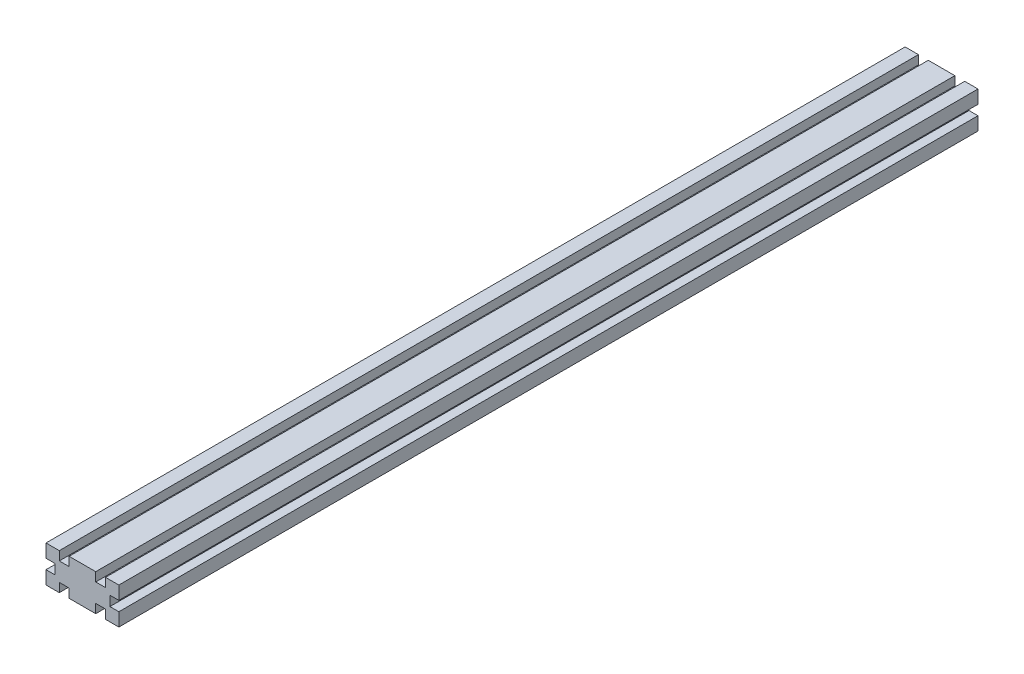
ISO-10303-21;
HEADER;
FILE_DESCRIPTION(('STEP AP214'),'2;1');
FILE_NAME('part.step','',(''),(''),'','','');
FILE_SCHEMA(('AUTOMOTIVE_DESIGN { 1 0 10303 214 1 1 1 1 }'));
ENDSEC;
DATA;
#1=APPLICATION_CONTEXT('core data for automotive mechanical design processes');
#2=APPLICATION_PROTOCOL_DEFINITION('international standard','automotive_design',2000,#1);
#3=PRODUCT_CONTEXT('',#1,'mechanical');
#4=PRODUCT('Part','Part','',(#3));
#5=PRODUCT_RELATED_PRODUCT_CATEGORY('part','',(#4));
#6=PRODUCT_DEFINITION_FORMATION('','',#4);
#7=PRODUCT_DEFINITION_CONTEXT('part definition',#1,'design');
#8=PRODUCT_DEFINITION('design','',#6,#7);
#9=PRODUCT_DEFINITION_SHAPE('','',#8);
#10=(LENGTH_UNIT() NAMED_UNIT(*) SI_UNIT(.MILLI.,.METRE.));
#11=(NAMED_UNIT(*) PLANE_ANGLE_UNIT() SI_UNIT($,.RADIAN.));
#12=(NAMED_UNIT(*) SI_UNIT($,.STERADIAN.) SOLID_ANGLE_UNIT());
#13=UNCERTAINTY_MEASURE_WITH_UNIT(LENGTH_MEASURE(1.E-05),#10,'distance_accuracy_value','');
#14=(GEOMETRIC_REPRESENTATION_CONTEXT(3) GLOBAL_UNCERTAINTY_ASSIGNED_CONTEXT((#13)) GLOBAL_UNIT_ASSIGNED_CONTEXT((#10,
#11,#12)) REPRESENTATION_CONTEXT('',''));
#15=CARTESIAN_POINT('',(0.,0.,0.));
#16=DIRECTION('',(0.,0.,1.));
#17=DIRECTION('',(1.,0.,0.));
#18=AXIS2_PLACEMENT_3D('',#15,#16,#17);
#19=CARTESIAN_POINT('',(11.6,0.,750.));
#20=DIRECTION('',(1.,0.,0.));
#21=DIRECTION('',(0.,1.,0.));
#22=AXIS2_PLACEMENT_3D('',#19,#20,#21);
#23=PLANE('',#22);
#24=DIRECTION('',(0.,-1.,0.));
#25=VECTOR('',#24,1.);
#26=CARTESIAN_POINT('',(11.6,0.,0.));
#27=LINE('',#26,#25);
#28=CARTESIAN_POINT('',(11.6,31.8,0.));
#29=VERTEX_POINT('',#28);
#30=CARTESIAN_POINT('',(11.6,24.,0.));
#31=VERTEX_POINT('',#30);
#32=EDGE_CURVE('E247',#29,#31,#27,.T.);
#33=ORIENTED_EDGE('',*,*,#32,.F.);
#34=DIRECTION('',(0.,0.,-1.));
#35=VECTOR('',#34,1.);
#36=CARTESIAN_POINT('',(11.6,31.8,750.));
#37=LINE('',#36,#35);
#38=CARTESIAN_POINT('',(11.6,31.8,750.));
#39=VERTEX_POINT('',#38);
#40=EDGE_CURVE('E11',#39,#29,#37,.T.);
#41=ORIENTED_EDGE('',*,*,#40,.F.);
#42=DIRECTION('',(0.,-1.,0.));
#43=VECTOR('',#42,1.);
#44=CARTESIAN_POINT('',(11.6,0.,750.));
#45=LINE('',#44,#43);
#46=CARTESIAN_POINT('',(11.6,24.,750.));
#47=VERTEX_POINT('',#46);
#48=EDGE_CURVE('E319',#39,#47,#45,.T.);
#49=ORIENTED_EDGE('',*,*,#48,.T.);
#50=DIRECTION('',(0.,0.,-1.));
#51=VECTOR('',#50,1.);
#52=CARTESIAN_POINT('',(11.6,24.,750.));
#53=LINE('',#52,#51);
#54=EDGE_CURVE('E50',#47,#31,#53,.T.);
#55=ORIENTED_EDGE('',*,*,#54,.T.);
#56=EDGE_LOOP('',(#33,#41,#49,#55));
#57=FACE_BOUND('',#56,.T.);
#58=ADVANCED_FACE('F34',(#57),#23,.T.);
#59=CARTESIAN_POINT('',(0.,31.8,750.));
#60=DIRECTION('',(0.,1.,0.));
#61=DIRECTION('',(0.,0.,1.));
#62=AXIS2_PLACEMENT_3D('',#59,#60,#61);
#63=PLANE('',#62);
#64=DIRECTION('',(1.,0.,0.));
#65=VECTOR('',#64,1.);
#66=CARTESIAN_POINT('',(0.,31.8,0.));
#67=LINE('',#66,#65);
#68=CARTESIAN_POINT('',(-11.6,31.8,0.));
#69=VERTEX_POINT('',#68);
#70=EDGE_CURVE('E249',#69,#29,#67,.T.);
#71=ORIENTED_EDGE('',*,*,#70,.F.);
#72=DIRECTION('',(0.,0.,-1.));
#73=VECTOR('',#72,1.);
#74=CARTESIAN_POINT('',(-11.6,31.8,750.));
#75=LINE('',#74,#73);
#76=CARTESIAN_POINT('',(-11.6,31.8,750.));
#77=VERTEX_POINT('',#76);
#78=EDGE_CURVE('E42',#77,#69,#75,.T.);
#79=ORIENTED_EDGE('',*,*,#78,.F.);
#80=DIRECTION('',(1.,0.,0.));
#81=VECTOR('',#80,1.);
#82=CARTESIAN_POINT('',(0.,31.8,750.));
#83=LINE('',#82,#81);
#84=EDGE_CURVE('E396',#77,#39,#83,.T.);
#85=ORIENTED_EDGE('',*,*,#84,.T.);
#86=ORIENTED_EDGE('',*,*,#40,.T.);
#87=EDGE_LOOP('',(#71,#79,#85,#86));
#88=FACE_BOUND('',#87,.T.);
#89=ADVANCED_FACE('F384',(#88),#63,.T.);
#90=CARTESIAN_POINT('',(-11.6,0.,750.));
#91=DIRECTION('',(-1.,0.,0.));
#92=DIRECTION('',(0.,0.,1.));
#93=AXIS2_PLACEMENT_3D('',#90,#91,#92);
#94=PLANE('',#93);
#95=DIRECTION('',(0.,1.,0.));
#96=VECTOR('',#95,1.);
#97=CARTESIAN_POINT('',(-11.6,0.,0.));
#98=LINE('',#97,#96);
#99=CARTESIAN_POINT('',(-11.6,24.,0.));
#100=VERTEX_POINT('',#99);
#101=EDGE_CURVE('E252',#100,#69,#98,.T.);
#102=ORIENTED_EDGE('',*,*,#101,.F.);
#103=DIRECTION('',(0.,0.,-1.));
#104=VECTOR('',#103,1.);
#105=CARTESIAN_POINT('',(-11.6,24.,750.));
#106=LINE('',#105,#104);
#107=CARTESIAN_POINT('',(-11.6,24.,750.));
#108=VERTEX_POINT('',#107);
#109=EDGE_CURVE('E373',#108,#100,#106,.T.);
#110=ORIENTED_EDGE('',*,*,#109,.F.);
#111=DIRECTION('',(0.,1.,0.));
#112=VECTOR('',#111,1.);
#113=CARTESIAN_POINT('',(-11.6,0.,750.));
#114=LINE('',#113,#112);
#115=EDGE_CURVE('E380',#108,#77,#114,.T.);
#116=ORIENTED_EDGE('',*,*,#115,.T.);
#117=ORIENTED_EDGE('',*,*,#78,.T.);
#118=EDGE_LOOP('',(#102,#110,#116,#117));
#119=FACE_BOUND('',#118,.T.);
#120=ADVANCED_FACE('F378',(#119),#94,.T.);
#121=CARTESIAN_POINT('',(0.,24.,750.));
#122=DIRECTION('',(0.,1.,0.));
#123=DIRECTION('',(0.,0.,1.));
#124=AXIS2_PLACEMENT_3D('',#121,#122,#123);
#125=PLANE('',#124);
#126=DIRECTION('',(1.,0.,0.));
#127=VECTOR('',#126,1.);
#128=CARTESIAN_POINT('',(0.,24.,0.));
#129=LINE('',#128,#127);
#130=CARTESIAN_POINT('',(-20.2,24.,0.));
#131=VERTEX_POINT('',#130);
#132=EDGE_CURVE('E255',#131,#100,#129,.T.);
#133=ORIENTED_EDGE('',*,*,#132,.F.);
#134=DIRECTION('',(0.,0.,-1.));
#135=VECTOR('',#134,1.);
#136=CARTESIAN_POINT('',(-20.2,24.,750.));
#137=LINE('',#136,#135);
#138=CARTESIAN_POINT('',(-20.2,24.,750.));
#139=VERTEX_POINT('',#138);
#140=EDGE_CURVE('E371',#139,#131,#137,.T.);
#141=ORIENTED_EDGE('',*,*,#140,.F.);
#142=DIRECTION('',(1.,0.,0.));
#143=VECTOR('',#142,1.);
#144=CARTESIAN_POINT('',(0.,24.,750.));
#145=LINE('',#144,#143);
#146=EDGE_CURVE('E393',#139,#108,#145,.T.);
#147=ORIENTED_EDGE('',*,*,#146,.T.);
#148=ORIENTED_EDGE('',*,*,#109,.T.);
#149=EDGE_LOOP('',(#133,#141,#147,#148));
#150=FACE_BOUND('',#149,.T.);
#151=ADVANCED_FACE('F390',(#150),#125,.T.);
#152=CARTESIAN_POINT('',(-20.2,0.,750.));
#153=DIRECTION('',(1.,0.,0.));
#154=DIRECTION('',(0.,0.,-1.));
#155=AXIS2_PLACEMENT_3D('',#152,#153,#154);
#156=PLANE('',#155);
#157=DIRECTION('',(0.,-1.,0.));
#158=VECTOR('',#157,1.);
#159=CARTESIAN_POINT('',(-20.2,0.,0.));
#160=LINE('',#159,#158);
#161=CARTESIAN_POINT('',(-20.2,31.8,0.));
#162=VERTEX_POINT('',#161);
#163=EDGE_CURVE('E258',#162,#131,#160,.T.);
#164=ORIENTED_EDGE('',*,*,#163,.F.);
#165=DIRECTION('',(0.,0.,-1.));
#166=VECTOR('',#165,1.);
#167=CARTESIAN_POINT('',(-20.2,31.8,750.));
#168=LINE('',#167,#166);
#169=CARTESIAN_POINT('',(-20.2,31.8,750.));
#170=VERTEX_POINT('',#169);
#171=EDGE_CURVE('E369',#170,#162,#168,.T.);
#172=ORIENTED_EDGE('',*,*,#171,.F.);
#173=DIRECTION('',(0.,-1.,0.));
#174=VECTOR('',#173,1.);
#175=CARTESIAN_POINT('',(-20.2,0.,750.));
#176=LINE('',#175,#174);
#177=EDGE_CURVE('E398',#170,#139,#176,.T.);
#178=ORIENTED_EDGE('',*,*,#177,.T.);
#179=ORIENTED_EDGE('',*,*,#140,.T.);
#180=EDGE_LOOP('',(#164,#172,#178,#179));
#181=FACE_BOUND('',#180,.T.);
#182=ADVANCED_FACE('F476',(#181),#156,.T.);
#183=CARTESIAN_POINT('',(0.,31.8,750.));
#184=DIRECTION('',(0.,1.,0.));
#185=DIRECTION('',(0.,0.,1.));
#186=AXIS2_PLACEMENT_3D('',#183,#184,#185);
#187=PLANE('',#186);
#188=DIRECTION('',(1.,0.,0.));
#189=VECTOR('',#188,1.);
#190=CARTESIAN_POINT('',(0.,31.8,0.));
#191=LINE('',#190,#189);
#192=CARTESIAN_POINT('',(-31.8,31.8,0.));
#193=VERTEX_POINT('',#192);
#194=EDGE_CURVE('E261',#193,#162,#191,.T.);
#195=ORIENTED_EDGE('',*,*,#194,.F.);
#196=DIRECTION('',(0.,0.,-1.));
#197=VECTOR('',#196,1.);
#198=CARTESIAN_POINT('',(-31.8,31.8,750.));
#199=LINE('',#198,#197);
#200=CARTESIAN_POINT('',(-31.8,31.8,750.));
#201=VERTEX_POINT('',#200);
#202=EDGE_CURVE('E367',#201,#193,#199,.T.);
#203=ORIENTED_EDGE('',*,*,#202,.F.);
#204=DIRECTION('',(1.,0.,0.));
#205=VECTOR('',#204,1.);
#206=CARTESIAN_POINT('',(0.,31.8,750.));
#207=LINE('',#206,#205);
#208=EDGE_CURVE('E404',#201,#170,#207,.T.);
#209=ORIENTED_EDGE('',*,*,#208,.T.);
#210=ORIENTED_EDGE('',*,*,#171,.T.);
#211=EDGE_LOOP('',(#195,#203,#209,#210));
#212=FACE_BOUND('',#211,.T.);
#213=ADVANCED_FACE('F479',(#212),#187,.T.);
#214=CARTESIAN_POINT('',(-31.8,0.,750.));
#215=DIRECTION('',(-1.,0.,0.));
#216=DIRECTION('',(0.,0.,1.));
#217=AXIS2_PLACEMENT_3D('',#214,#215,#216);
#218=PLANE('',#217);
#219=DIRECTION('',(0.,1.,0.));
#220=VECTOR('',#219,1.);
#221=CARTESIAN_POINT('',(-31.8,0.,0.));
#222=LINE('',#221,#220);
#223=CARTESIAN_POINT('',(-31.8,20.2,0.));
#224=VERTEX_POINT('',#223);
#225=EDGE_CURVE('E264',#224,#193,#222,.T.);
#226=ORIENTED_EDGE('',*,*,#225,.F.);
#227=DIRECTION('',(0.,0.,-1.));
#228=VECTOR('',#227,1.);
#229=CARTESIAN_POINT('',(-31.8,20.2,750.));
#230=LINE('',#229,#228);
#231=CARTESIAN_POINT('',(-31.8,20.2,750.));
#232=VERTEX_POINT('',#231);
#233=EDGE_CURVE('E365',#232,#224,#230,.T.);
#234=ORIENTED_EDGE('',*,*,#233,.F.);
#235=DIRECTION('',(0.,1.,0.));
#236=VECTOR('',#235,1.);
#237=CARTESIAN_POINT('',(-31.8,0.,750.));
#238=LINE('',#237,#236);
#239=EDGE_CURVE('E407',#232,#201,#238,.T.);
#240=ORIENTED_EDGE('',*,*,#239,.T.);
#241=ORIENTED_EDGE('',*,*,#202,.T.);
#242=EDGE_LOOP('',(#226,#234,#240,#241));
#243=FACE_BOUND('',#242,.T.);
#244=ADVANCED_FACE('F483',(#243),#218,.T.);
#245=CARTESIAN_POINT('',(0.,20.2,750.));
#246=DIRECTION('',(0.,-1.,0.));
#247=DIRECTION('',(1.,0.,0.));
#248=AXIS2_PLACEMENT_3D('',#245,#246,#247);
#249=PLANE('',#248);
#250=DIRECTION('',(-1.,0.,0.));
#251=VECTOR('',#250,1.);
#252=CARTESIAN_POINT('',(0.,20.2,0.));
#253=LINE('',#252,#251);
#254=CARTESIAN_POINT('',(-24.,20.2,0.));
#255=VERTEX_POINT('',#254);
#256=EDGE_CURVE('E267',#255,#224,#253,.T.);
#257=ORIENTED_EDGE('',*,*,#256,.F.);
#258=DIRECTION('',(0.,0.,-1.));
#259=VECTOR('',#258,1.);
#260=CARTESIAN_POINT('',(-24.,20.2,750.));
#261=LINE('',#260,#259);
#262=CARTESIAN_POINT('',(-24.,20.2,750.));
#263=VERTEX_POINT('',#262);
#264=EDGE_CURVE('E363',#263,#255,#261,.T.);
#265=ORIENTED_EDGE('',*,*,#264,.F.);
#266=DIRECTION('',(-1.,0.,0.));
#267=VECTOR('',#266,1.);
#268=CARTESIAN_POINT('',(0.,20.2,750.));
#269=LINE('',#268,#267);
#270=EDGE_CURVE('E410',#263,#232,#269,.T.);
#271=ORIENTED_EDGE('',*,*,#270,.T.);
#272=ORIENTED_EDGE('',*,*,#233,.T.);
#273=EDGE_LOOP('',(#257,#265,#271,#272));
#274=FACE_BOUND('',#273,.T.);
#275=ADVANCED_FACE('F487',(#274),#249,.T.);
#276=CARTESIAN_POINT('',(-24.,0.,750.));
#277=DIRECTION('',(-1.,0.,0.));
#278=DIRECTION('',(0.,-1.,0.));
#279=AXIS2_PLACEMENT_3D('',#276,#277,#278);
#280=PLANE('',#279);
#281=DIRECTION('',(0.,1.,0.));
#282=VECTOR('',#281,1.);
#283=CARTESIAN_POINT('',(-24.,0.,0.));
#284=LINE('',#283,#282);
#285=CARTESIAN_POINT('',(-24.,11.6,0.));
#286=VERTEX_POINT('',#285);
#287=EDGE_CURVE('E270',#286,#255,#284,.T.);
#288=ORIENTED_EDGE('',*,*,#287,.F.);
#289=DIRECTION('',(0.,0.,-1.));
#290=VECTOR('',#289,1.);
#291=CARTESIAN_POINT('',(-24.,11.6,750.));
#292=LINE('',#291,#290);
#293=CARTESIAN_POINT('',(-24.,11.6,750.));
#294=VERTEX_POINT('',#293);
#295=EDGE_CURVE('E361',#294,#286,#292,.T.);
#296=ORIENTED_EDGE('',*,*,#295,.F.);
#297=DIRECTION('',(0.,1.,0.));
#298=VECTOR('',#297,1.);
#299=CARTESIAN_POINT('',(-24.,0.,750.));
#300=LINE('',#299,#298);
#301=EDGE_CURVE('E413',#294,#263,#300,.T.);
#302=ORIENTED_EDGE('',*,*,#301,.T.);
#303=ORIENTED_EDGE('',*,*,#264,.T.);
#304=EDGE_LOOP('',(#288,#296,#302,#303));
#305=FACE_BOUND('',#304,.T.);
#306=ADVANCED_FACE('F491',(#305),#280,.T.);
#307=CARTESIAN_POINT('',(0.,11.6,750.));
#308=DIRECTION('',(0.,1.,0.));
#309=DIRECTION('',(0.,0.,1.));
#310=AXIS2_PLACEMENT_3D('',#307,#308,#309);
#311=PLANE('',#310);
#312=DIRECTION('',(1.,0.,0.));
#313=VECTOR('',#312,1.);
#314=CARTESIAN_POINT('',(0.,11.6,0.));
#315=LINE('',#314,#313);
#316=CARTESIAN_POINT('',(-31.8,11.6,0.));
#317=VERTEX_POINT('',#316);
#318=EDGE_CURVE('E273',#317,#286,#315,.T.);
#319=ORIENTED_EDGE('',*,*,#318,.F.);
#320=DIRECTION('',(0.,0.,-1.));
#321=VECTOR('',#320,1.);
#322=CARTESIAN_POINT('',(-31.8,11.6,750.));
#323=LINE('',#322,#321);
#324=CARTESIAN_POINT('',(-31.8,11.6,750.));
#325=VERTEX_POINT('',#324);
#326=EDGE_CURVE('E359',#325,#317,#323,.T.);
#327=ORIENTED_EDGE('',*,*,#326,.F.);
#328=DIRECTION('',(1.,0.,0.));
#329=VECTOR('',#328,1.);
#330=CARTESIAN_POINT('',(0.,11.6,750.));
#331=LINE('',#330,#329);
#332=EDGE_CURVE('E416',#325,#294,#331,.T.);
#333=ORIENTED_EDGE('',*,*,#332,.T.);
#334=ORIENTED_EDGE('',*,*,#295,.T.);
#335=EDGE_LOOP('',(#319,#327,#333,#334));
#336=FACE_BOUND('',#335,.T.);
#337=ADVANCED_FACE('F495',(#336),#311,.T.);
#338=CARTESIAN_POINT('',(-31.8,0.,750.));
#339=DIRECTION('',(-1.,0.,0.));
#340=DIRECTION('',(0.,0.,1.));
#341=AXIS2_PLACEMENT_3D('',#338,#339,#340);
#342=PLANE('',#341);
#343=DIRECTION('',(0.,1.,0.));
#344=VECTOR('',#343,1.);
#345=CARTESIAN_POINT('',(-31.8,0.,0.));
#346=LINE('',#345,#344);
#347=CARTESIAN_POINT('',(-31.8,0.,0.));
#348=VERTEX_POINT('',#347);
#349=EDGE_CURVE('E276',#348,#317,#346,.T.);
#350=ORIENTED_EDGE('',*,*,#349,.F.);
#351=DIRECTION('',(0.,0.,-1.));
#352=VECTOR('',#351,1.);
#353=CARTESIAN_POINT('',(-31.8,0.,750.));
#354=LINE('',#353,#352);
#355=CARTESIAN_POINT('',(-31.8,0.,750.));
#356=VERTEX_POINT('',#355);
#357=EDGE_CURVE('E357',#356,#348,#354,.T.);
#358=ORIENTED_EDGE('',*,*,#357,.F.);
#359=DIRECTION('',(0.,1.,0.));
#360=VECTOR('',#359,1.);
#361=CARTESIAN_POINT('',(-31.8,0.,750.));
#362=LINE('',#361,#360);
#363=EDGE_CURVE('E419',#356,#325,#362,.T.);
#364=ORIENTED_EDGE('',*,*,#363,.T.);
#365=ORIENTED_EDGE('',*,*,#326,.T.);
#366=EDGE_LOOP('',(#350,#358,#364,#365));
#367=FACE_BOUND('',#366,.T.);
#368=ADVANCED_FACE('F499',(#367),#342,.T.);
#369=CARTESIAN_POINT('',(0.,0.,750.));
#370=DIRECTION('',(0.,1.,0.));
#371=DIRECTION('',(0.,0.,1.));
#372=AXIS2_PLACEMENT_3D('',#369,#370,#371);
#373=PLANE('',#372);
#374=DIRECTION('',(1.,0.,0.));
#375=VECTOR('',#374,1.);
#376=CARTESIAN_POINT('',(0.,0.,0.));
#377=LINE('',#376,#375);
#378=CARTESIAN_POINT('',(-20.2,0.,0.));
#379=VERTEX_POINT('',#378);
#380=EDGE_CURVE('E279',#348,#379,#377,.T.);
#381=ORIENTED_EDGE('',*,*,#380,.T.);
#382=DIRECTION('',(0.,0.,-1.));
#383=VECTOR('',#382,1.);
#384=CARTESIAN_POINT('',(-20.2,0.,750.));
#385=LINE('',#384,#383);
#386=CARTESIAN_POINT('',(-20.2,0.,750.));
#387=VERTEX_POINT('',#386);
#388=EDGE_CURVE('E354',#387,#379,#385,.T.);
#389=ORIENTED_EDGE('',*,*,#388,.F.);
#390=DIRECTION('',(1.,0.,0.));
#391=VECTOR('',#390,1.);
#392=CARTESIAN_POINT('',(0.,0.,750.));
#393=LINE('',#392,#391);
#394=EDGE_CURVE('E422',#356,#387,#393,.T.);
#395=ORIENTED_EDGE('',*,*,#394,.F.);
#396=ORIENTED_EDGE('',*,*,#357,.T.);
#397=EDGE_LOOP('',(#381,#389,#395,#396));
#398=FACE_BOUND('',#397,.T.);
#399=ADVANCED_FACE('F503',(#398),#373,.F.);
#400=CARTESIAN_POINT('',(-20.2,0.,750.));
#401=DIRECTION('',(-1.,0.,0.));
#402=DIRECTION('',(0.,0.,1.));
#403=AXIS2_PLACEMENT_3D('',#400,#401,#402);
#404=PLANE('',#403);
#405=DIRECTION('',(0.,1.,0.));
#406=VECTOR('',#405,1.);
#407=CARTESIAN_POINT('',(-20.2,0.,0.));
#408=LINE('',#407,#406);
#409=CARTESIAN_POINT('',(-20.2,7.79999999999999,0.));
#410=VERTEX_POINT('',#409);
#411=EDGE_CURVE('E281',#379,#410,#408,.T.);
#412=ORIENTED_EDGE('',*,*,#411,.T.);
#413=DIRECTION('',(0.,0.,-1.));
#414=VECTOR('',#413,1.);
#415=CARTESIAN_POINT('',(-20.2,7.79999999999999,750.));
#416=LINE('',#415,#414);
#417=CARTESIAN_POINT('',(-20.2,7.79999999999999,750.));
#418=VERTEX_POINT('',#417);
#419=EDGE_CURVE('E351',#418,#410,#416,.T.);
#420=ORIENTED_EDGE('',*,*,#419,.F.);
#421=DIRECTION('',(0.,1.,0.));
#422=VECTOR('',#421,1.);
#423=CARTESIAN_POINT('',(-20.2,0.,750.));
#424=LINE('',#423,#422);
#425=EDGE_CURVE('E424',#387,#418,#424,.T.);
#426=ORIENTED_EDGE('',*,*,#425,.F.);
#427=ORIENTED_EDGE('',*,*,#388,.T.);
#428=EDGE_LOOP('',(#412,#420,#426,#427));
#429=FACE_BOUND('',#428,.T.);
#430=ADVANCED_FACE('F507',(#429),#404,.F.);
#431=CARTESIAN_POINT('',(0.,7.79999999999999,750.));
#432=DIRECTION('',(0.,1.,0.));
#433=DIRECTION('',(0.,0.,1.));
#434=AXIS2_PLACEMENT_3D('',#431,#432,#433);
#435=PLANE('',#434);
#436=DIRECTION('',(1.,0.,0.));
#437=VECTOR('',#436,1.);
#438=CARTESIAN_POINT('',(0.,7.79999999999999,0.));
#439=LINE('',#438,#437);
#440=CARTESIAN_POINT('',(-11.6,7.79999999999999,0.));
#441=VERTEX_POINT('',#440);
#442=EDGE_CURVE('E283',#410,#441,#439,.T.);
#443=ORIENTED_EDGE('',*,*,#442,.T.);
#444=DIRECTION('',(0.,0.,-1.));
#445=VECTOR('',#444,1.);
#446=CARTESIAN_POINT('',(-11.6,7.79999999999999,750.));
#447=LINE('',#446,#445);
#448=CARTESIAN_POINT('',(-11.6,7.79999999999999,750.));
#449=VERTEX_POINT('',#448);
#450=EDGE_CURVE('E348',#449,#441,#447,.T.);
#451=ORIENTED_EDGE('',*,*,#450,.F.);
#452=DIRECTION('',(1.,0.,0.));
#453=VECTOR('',#452,1.);
#454=CARTESIAN_POINT('',(0.,7.79999999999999,750.));
#455=LINE('',#454,#453);
#456=EDGE_CURVE('E426',#418,#449,#455,.T.);
#457=ORIENTED_EDGE('',*,*,#456,.F.);
#458=ORIENTED_EDGE('',*,*,#419,.T.);
#459=EDGE_LOOP('',(#443,#451,#457,#458));
#460=FACE_BOUND('',#459,.T.);
#461=ADVANCED_FACE('F511',(#460),#435,.F.);
#462=CARTESIAN_POINT('',(-11.6,0.,750.));
#463=DIRECTION('',(1.,0.,0.));
#464=DIRECTION('',(0.,0.,-1.));
#465=AXIS2_PLACEMENT_3D('',#462,#463,#464);
#466=PLANE('',#465);
#467=DIRECTION('',(0.,-1.,0.));
#468=VECTOR('',#467,1.);
#469=CARTESIAN_POINT('',(-11.6,0.,0.));
#470=LINE('',#469,#468);
#471=CARTESIAN_POINT('',(-11.6,0.,0.));
#472=VERTEX_POINT('',#471);
#473=EDGE_CURVE('E285',#441,#472,#470,.T.);
#474=ORIENTED_EDGE('',*,*,#473,.T.);
#475=DIRECTION('',(0.,0.,-1.));
#476=VECTOR('',#475,1.);
#477=CARTESIAN_POINT('',(-11.6,0.,750.));
#478=LINE('',#477,#476);
#479=CARTESIAN_POINT('',(-11.6,0.,750.));
#480=VERTEX_POINT('',#479);
#481=EDGE_CURVE('E345',#480,#472,#478,.T.);
#482=ORIENTED_EDGE('',*,*,#481,.F.);
#483=DIRECTION('',(0.,-1.,0.));
#484=VECTOR('',#483,1.);
#485=CARTESIAN_POINT('',(-11.6,0.,750.));
#486=LINE('',#485,#484);
#487=EDGE_CURVE('E428',#449,#480,#486,.T.);
#488=ORIENTED_EDGE('',*,*,#487,.F.);
#489=ORIENTED_EDGE('',*,*,#450,.T.);
#490=EDGE_LOOP('',(#474,#482,#488,#489));
#491=FACE_BOUND('',#490,.T.);
#492=ADVANCED_FACE('F515',(#491),#466,.F.);
#493=CARTESIAN_POINT('',(0.,0.,750.));
#494=DIRECTION('',(0.,1.,0.));
#495=DIRECTION('',(0.,0.,1.));
#496=AXIS2_PLACEMENT_3D('',#493,#494,#495);
#497=PLANE('',#496);
#498=DIRECTION('',(1.,0.,0.));
#499=VECTOR('',#498,1.);
#500=CARTESIAN_POINT('',(0.,0.,0.));
#501=LINE('',#500,#499);
#502=CARTESIAN_POINT('',(11.6,0.,0.));
#503=VERTEX_POINT('',#502);
#504=EDGE_CURVE('E287',#472,#503,#501,.T.);
#505=ORIENTED_EDGE('',*,*,#504,.T.);
#506=DIRECTION('',(0.,0.,-1.));
#507=VECTOR('',#506,1.);
#508=CARTESIAN_POINT('',(11.6,0.,750.));
#509=LINE('',#508,#507);
#510=CARTESIAN_POINT('',(11.6,0.,750.));
#511=VERTEX_POINT('',#510);
#512=EDGE_CURVE('E342',#511,#503,#509,.T.);
#513=ORIENTED_EDGE('',*,*,#512,.F.);
#514=DIRECTION('',(1.,0.,0.));
#515=VECTOR('',#514,1.);
#516=CARTESIAN_POINT('',(0.,0.,750.));
#517=LINE('',#516,#515);
#518=EDGE_CURVE('E430',#480,#511,#517,.T.);
#519=ORIENTED_EDGE('',*,*,#518,.F.);
#520=ORIENTED_EDGE('',*,*,#481,.T.);
#521=EDGE_LOOP('',(#505,#513,#519,#520));
#522=FACE_BOUND('',#521,.T.);
#523=ADVANCED_FACE('F519',(#522),#497,.F.);
#524=CARTESIAN_POINT('',(11.6,0.,750.));
#525=DIRECTION('',(-1.,0.,0.));
#526=DIRECTION('',(0.,-1.,0.));
#527=AXIS2_PLACEMENT_3D('',#524,#525,#526);
#528=PLANE('',#527);
#529=DIRECTION('',(0.,1.,0.));
#530=VECTOR('',#529,1.);
#531=CARTESIAN_POINT('',(11.6,0.,0.));
#532=LINE('',#531,#530);
#533=CARTESIAN_POINT('',(11.6,7.8,0.));
#534=VERTEX_POINT('',#533);
#535=EDGE_CURVE('E289',#503,#534,#532,.T.);
#536=ORIENTED_EDGE('',*,*,#535,.T.);
#537=DIRECTION('',(0.,0.,-1.));
#538=VECTOR('',#537,1.);
#539=CARTESIAN_POINT('',(11.6,7.8,750.));
#540=LINE('',#539,#538);
#541=CARTESIAN_POINT('',(11.6,7.8,750.));
#542=VERTEX_POINT('',#541);
#543=EDGE_CURVE('E339',#542,#534,#540,.T.);
#544=ORIENTED_EDGE('',*,*,#543,.F.);
#545=DIRECTION('',(0.,1.,0.));
#546=VECTOR('',#545,1.);
#547=CARTESIAN_POINT('',(11.6,0.,750.));
#548=LINE('',#547,#546);
#549=EDGE_CURVE('E432',#511,#542,#548,.T.);
#550=ORIENTED_EDGE('',*,*,#549,.F.);
#551=ORIENTED_EDGE('',*,*,#512,.T.);
#552=EDGE_LOOP('',(#536,#544,#550,#551));
#553=FACE_BOUND('',#552,.T.);
#554=ADVANCED_FACE('F523',(#553),#528,.F.);
#555=CARTESIAN_POINT('',(0.,7.8,750.));
#556=DIRECTION('',(0.,1.,0.));
#557=DIRECTION('',(-1.,0.,0.));
#558=AXIS2_PLACEMENT_3D('',#555,#556,#557);
#559=PLANE('',#558);
#560=DIRECTION('',(1.,0.,0.));
#561=VECTOR('',#560,1.);
#562=CARTESIAN_POINT('',(0.,7.8,0.));
#563=LINE('',#562,#561);
#564=CARTESIAN_POINT('',(20.2,7.8,0.));
#565=VERTEX_POINT('',#564);
#566=EDGE_CURVE('E291',#534,#565,#563,.T.);
#567=ORIENTED_EDGE('',*,*,#566,.T.);
#568=DIRECTION('',(0.,0.,-1.));
#569=VECTOR('',#568,1.);
#570=CARTESIAN_POINT('',(20.2,7.8,750.));
#571=LINE('',#570,#569);
#572=CARTESIAN_POINT('',(20.2,7.8,750.));
#573=VERTEX_POINT('',#572);
#574=EDGE_CURVE('E336',#573,#565,#571,.T.);
#575=ORIENTED_EDGE('',*,*,#574,.F.);
#576=DIRECTION('',(1.,0.,0.));
#577=VECTOR('',#576,1.);
#578=CARTESIAN_POINT('',(0.,7.8,750.));
#579=LINE('',#578,#577);
#580=EDGE_CURVE('E434',#542,#573,#579,.T.);
#581=ORIENTED_EDGE('',*,*,#580,.F.);
#582=ORIENTED_EDGE('',*,*,#543,.T.);
#583=EDGE_LOOP('',(#567,#575,#581,#582));
#584=FACE_BOUND('',#583,.T.);
#585=ADVANCED_FACE('F527',(#584),#559,.F.);
#586=CARTESIAN_POINT('',(20.2,0.,750.));
#587=DIRECTION('',(1.,0.,0.));
#588=DIRECTION('',(0.,0.,-1.));
#589=AXIS2_PLACEMENT_3D('',#586,#587,#588);
#590=PLANE('',#589);
#591=DIRECTION('',(0.,-1.,0.));
#592=VECTOR('',#591,1.);
#593=CARTESIAN_POINT('',(20.2,0.,0.));
#594=LINE('',#593,#592);
#595=CARTESIAN_POINT('',(20.2,0.,0.));
#596=VERTEX_POINT('',#595);
#597=EDGE_CURVE('E293',#565,#596,#594,.T.);
#598=ORIENTED_EDGE('',*,*,#597,.T.);
#599=DIRECTION('',(0.,0.,-1.));
#600=VECTOR('',#599,1.);
#601=CARTESIAN_POINT('',(20.2,0.,750.));
#602=LINE('',#601,#600);
#603=CARTESIAN_POINT('',(20.2,0.,750.));
#604=VERTEX_POINT('',#603);
#605=EDGE_CURVE('E333',#604,#596,#602,.T.);
#606=ORIENTED_EDGE('',*,*,#605,.F.);
#607=DIRECTION('',(0.,-1.,0.));
#608=VECTOR('',#607,1.);
#609=CARTESIAN_POINT('',(20.2,0.,750.));
#610=LINE('',#609,#608);
#611=EDGE_CURVE('E436',#573,#604,#610,.T.);
#612=ORIENTED_EDGE('',*,*,#611,.F.);
#613=ORIENTED_EDGE('',*,*,#574,.T.);
#614=EDGE_LOOP('',(#598,#606,#612,#613));
#615=FACE_BOUND('',#614,.T.);
#616=ADVANCED_FACE('F531',(#615),#590,.F.);
#617=CARTESIAN_POINT('',(0.,0.,750.));
#618=DIRECTION('',(0.,1.,0.));
#619=DIRECTION('',(0.,0.,1.));
#620=AXIS2_PLACEMENT_3D('',#617,#618,#619);
#621=PLANE('',#620);
#622=DIRECTION('',(1.,0.,0.));
#623=VECTOR('',#622,1.);
#624=CARTESIAN_POINT('',(0.,0.,0.));
#625=LINE('',#624,#623);
#626=CARTESIAN_POINT('',(31.8,0.,0.));
#627=VERTEX_POINT('',#626);
#628=EDGE_CURVE('E295',#596,#627,#625,.T.);
#629=ORIENTED_EDGE('',*,*,#628,.T.);
#630=DIRECTION('',(0.,0.,-1.));
#631=VECTOR('',#630,1.);
#632=CARTESIAN_POINT('',(31.8,0.,750.));
#633=LINE('',#632,#631);
#634=CARTESIAN_POINT('',(31.8,0.,750.));
#635=VERTEX_POINT('',#634);
#636=EDGE_CURVE('E331',#635,#627,#633,.T.);
#637=ORIENTED_EDGE('',*,*,#636,.F.);
#638=DIRECTION('',(1.,0.,0.));
#639=VECTOR('',#638,1.);
#640=CARTESIAN_POINT('',(0.,0.,750.));
#641=LINE('',#640,#639);
#642=EDGE_CURVE('E438',#604,#635,#641,.T.);
#643=ORIENTED_EDGE('',*,*,#642,.F.);
#644=ORIENTED_EDGE('',*,*,#605,.T.);
#645=EDGE_LOOP('',(#629,#637,#643,#644));
#646=FACE_BOUND('',#645,.T.);
#647=ADVANCED_FACE('F535',(#646),#621,.F.);
#648=CARTESIAN_POINT('',(31.8,0.,750.));
#649=DIRECTION('',(1.,0.,0.));
#650=DIRECTION('',(0.,0.,-1.));
#651=AXIS2_PLACEMENT_3D('',#648,#649,#650);
#652=PLANE('',#651);
#653=DIRECTION('',(0.,-1.,0.));
#654=VECTOR('',#653,1.);
#655=CARTESIAN_POINT('',(31.8,0.,0.));
#656=LINE('',#655,#654);
#657=CARTESIAN_POINT('',(31.8,11.6,0.));
#658=VERTEX_POINT('',#657);
#659=EDGE_CURVE('E298',#658,#627,#656,.T.);
#660=ORIENTED_EDGE('',*,*,#659,.F.);
#661=DIRECTION('',(0.,0.,-1.));
#662=VECTOR('',#661,1.);
#663=CARTESIAN_POINT('',(31.8,11.6,750.));
#664=LINE('',#663,#662);
#665=CARTESIAN_POINT('',(31.8,11.6,750.));
#666=VERTEX_POINT('',#665);
#667=EDGE_CURVE('E329',#666,#658,#664,.T.);
#668=ORIENTED_EDGE('',*,*,#667,.F.);
#669=DIRECTION('',(0.,-1.,0.));
#670=VECTOR('',#669,1.);
#671=CARTESIAN_POINT('',(31.8,0.,750.));
#672=LINE('',#671,#670);
#673=EDGE_CURVE('E440',#666,#635,#672,.T.);
#674=ORIENTED_EDGE('',*,*,#673,.T.);
#675=ORIENTED_EDGE('',*,*,#636,.T.);
#676=EDGE_LOOP('',(#660,#668,#674,#675));
#677=FACE_BOUND('',#676,.T.);
#678=ADVANCED_FACE('F539',(#677),#652,.T.);
#679=CARTESIAN_POINT('',(0.,11.6,750.));
#680=DIRECTION('',(0.,1.,0.));
#681=DIRECTION('',(0.,0.,1.));
#682=AXIS2_PLACEMENT_3D('',#679,#680,#681);
#683=PLANE('',#682);
#684=DIRECTION('',(1.,0.,0.));
#685=VECTOR('',#684,1.);
#686=CARTESIAN_POINT('',(0.,11.6,0.));
#687=LINE('',#686,#685);
#688=CARTESIAN_POINT('',(24.,11.6,0.));
#689=VERTEX_POINT('',#688);
#690=EDGE_CURVE('E301',#689,#658,#687,.T.);
#691=ORIENTED_EDGE('',*,*,#690,.F.);
#692=DIRECTION('',(0.,0.,-1.));
#693=VECTOR('',#692,1.);
#694=CARTESIAN_POINT('',(24.,11.6,750.));
#695=LINE('',#694,#693);
#696=CARTESIAN_POINT('',(24.,11.6,750.));
#697=VERTEX_POINT('',#696);
#698=EDGE_CURVE('E327',#697,#689,#695,.T.);
#699=ORIENTED_EDGE('',*,*,#698,.F.);
#700=DIRECTION('',(1.,0.,0.));
#701=VECTOR('',#700,1.);
#702=CARTESIAN_POINT('',(0.,11.6,750.));
#703=LINE('',#702,#701);
#704=EDGE_CURVE('E443',#697,#666,#703,.T.);
#705=ORIENTED_EDGE('',*,*,#704,.T.);
#706=ORIENTED_EDGE('',*,*,#667,.T.);
#707=EDGE_LOOP('',(#691,#699,#705,#706));
#708=FACE_BOUND('',#707,.T.);
#709=ADVANCED_FACE('F543',(#708),#683,.T.);
#710=CARTESIAN_POINT('',(24.,0.,750.));
#711=DIRECTION('',(1.,0.,0.));
#712=DIRECTION('',(0.,0.,-1.));
#713=AXIS2_PLACEMENT_3D('',#710,#711,#712);
#714=PLANE('',#713);
#715=DIRECTION('',(0.,-1.,0.));
#716=VECTOR('',#715,1.);
#717=CARTESIAN_POINT('',(24.,0.,0.));
#718=LINE('',#717,#716);
#719=CARTESIAN_POINT('',(24.,20.2,0.));
#720=VERTEX_POINT('',#719);
#721=EDGE_CURVE('E304',#720,#689,#718,.T.);
#722=ORIENTED_EDGE('',*,*,#721,.F.);
#723=DIRECTION('',(0.,0.,-1.));
#724=VECTOR('',#723,1.);
#725=CARTESIAN_POINT('',(24.,20.2,750.));
#726=LINE('',#725,#724);
#727=CARTESIAN_POINT('',(24.,20.2,750.));
#728=VERTEX_POINT('',#727);
#729=EDGE_CURVE('E325',#728,#720,#726,.T.);
#730=ORIENTED_EDGE('',*,*,#729,.F.);
#731=DIRECTION('',(0.,-1.,0.));
#732=VECTOR('',#731,1.);
#733=CARTESIAN_POINT('',(24.,0.,750.));
#734=LINE('',#733,#732);
#735=EDGE_CURVE('E446',#728,#697,#734,.T.);
#736=ORIENTED_EDGE('',*,*,#735,.T.);
#737=ORIENTED_EDGE('',*,*,#698,.T.);
#738=EDGE_LOOP('',(#722,#730,#736,#737));
#739=FACE_BOUND('',#738,.T.);
#740=ADVANCED_FACE('F547',(#739),#714,.T.);
#741=CARTESIAN_POINT('',(0.,20.2,750.));
#742=DIRECTION('',(0.,-1.,0.));
#743=DIRECTION('',(0.,0.,-1.));
#744=AXIS2_PLACEMENT_3D('',#741,#742,#743);
#745=PLANE('',#744);
#746=DIRECTION('',(-1.,0.,0.));
#747=VECTOR('',#746,1.);
#748=CARTESIAN_POINT('',(0.,20.2,0.));
#749=LINE('',#748,#747);
#750=CARTESIAN_POINT('',(31.8,20.2,0.));
#751=VERTEX_POINT('',#750);
#752=EDGE_CURVE('E307',#751,#720,#749,.T.);
#753=ORIENTED_EDGE('',*,*,#752,.F.);
#754=DIRECTION('',(0.,0.,-1.));
#755=VECTOR('',#754,1.);
#756=CARTESIAN_POINT('',(31.8,20.2,750.));
#757=LINE('',#756,#755);
#758=CARTESIAN_POINT('',(31.8,20.2,750.));
#759=VERTEX_POINT('',#758);
#760=EDGE_CURVE('E323',#759,#751,#757,.T.);
#761=ORIENTED_EDGE('',*,*,#760,.F.);
#762=DIRECTION('',(-1.,0.,0.));
#763=VECTOR('',#762,1.);
#764=CARTESIAN_POINT('',(0.,20.2,750.));
#765=LINE('',#764,#763);
#766=EDGE_CURVE('E449',#759,#728,#765,.T.);
#767=ORIENTED_EDGE('',*,*,#766,.T.);
#768=ORIENTED_EDGE('',*,*,#729,.T.);
#769=EDGE_LOOP('',(#753,#761,#767,#768));
#770=FACE_BOUND('',#769,.T.);
#771=ADVANCED_FACE('F551',(#770),#745,.T.);
#772=CARTESIAN_POINT('',(31.8,0.,750.));
#773=DIRECTION('',(1.,0.,0.));
#774=DIRECTION('',(0.,1.,0.));
#775=AXIS2_PLACEMENT_3D('',#772,#773,#774);
#776=PLANE('',#775);
#777=DIRECTION('',(0.,-1.,0.));
#778=VECTOR('',#777,1.);
#779=CARTESIAN_POINT('',(31.8,0.,0.));
#780=LINE('',#779,#778);
#781=CARTESIAN_POINT('',(31.8,31.8,0.));
#782=VERTEX_POINT('',#781);
#783=EDGE_CURVE('E310',#782,#751,#780,.T.);
#784=ORIENTED_EDGE('',*,*,#783,.F.);
#785=DIRECTION('',(0.,0.,-1.));
#786=VECTOR('',#785,1.);
#787=CARTESIAN_POINT('',(31.8,31.8,750.));
#788=LINE('',#787,#786);
#789=CARTESIAN_POINT('',(31.8,31.8,750.));
#790=VERTEX_POINT('',#789);
#791=EDGE_CURVE('E229',#790,#782,#788,.T.);
#792=ORIENTED_EDGE('',*,*,#791,.F.);
#793=DIRECTION('',(0.,-1.,0.));
#794=VECTOR('',#793,1.);
#795=CARTESIAN_POINT('',(31.8,0.,750.));
#796=LINE('',#795,#794);
#797=EDGE_CURVE('E239',#790,#759,#796,.T.);
#798=ORIENTED_EDGE('',*,*,#797,.T.);
#799=ORIENTED_EDGE('',*,*,#760,.T.);
#800=EDGE_LOOP('',(#784,#792,#798,#799));
#801=FACE_BOUND('',#800,.T.);
#802=ADVANCED_FACE('F453',(#801),#776,.T.);
#803=CARTESIAN_POINT('',(0.,31.8,750.));
#804=DIRECTION('',(0.,1.,0.));
#805=DIRECTION('',(0.,0.,1.));
#806=AXIS2_PLACEMENT_3D('',#803,#804,#805);
#807=PLANE('',#806);
#808=DIRECTION('',(1.,0.,0.));
#809=VECTOR('',#808,1.);
#810=CARTESIAN_POINT('',(0.,31.8,0.));
#811=LINE('',#810,#809);
#812=CARTESIAN_POINT('',(20.2,31.8,0.));
#813=VERTEX_POINT('',#812);
#814=EDGE_CURVE('E225',#813,#782,#811,.T.);
#815=ORIENTED_EDGE('',*,*,#814,.F.);
#816=DIRECTION('',(0.,0.,-1.));
#817=VECTOR('',#816,1.);
#818=CARTESIAN_POINT('',(20.2,31.8,750.));
#819=LINE('',#818,#817);
#820=CARTESIAN_POINT('',(20.2,31.8,750.));
#821=VERTEX_POINT('',#820);
#822=EDGE_CURVE('E220',#821,#813,#819,.T.);
#823=ORIENTED_EDGE('',*,*,#822,.F.);
#824=DIRECTION('',(1.,0.,0.));
#825=VECTOR('',#824,1.);
#826=CARTESIAN_POINT('',(0.,31.8,750.));
#827=LINE('',#826,#825);
#828=EDGE_CURVE('E223',#821,#790,#827,.T.);
#829=ORIENTED_EDGE('',*,*,#828,.T.);
#830=ORIENTED_EDGE('',*,*,#791,.T.);
#831=EDGE_LOOP('',(#815,#823,#829,#830));
#832=FACE_BOUND('',#831,.T.);
#833=ADVANCED_FACE('F222',(#832),#807,.T.);
#834=CARTESIAN_POINT('',(20.2,0.,750.));
#835=DIRECTION('',(-1.,0.,0.));
#836=DIRECTION('',(0.,-1.,0.));
#837=AXIS2_PLACEMENT_3D('',#834,#835,#836);
#838=PLANE('',#837);
#839=DIRECTION('',(0.,1.,0.));
#840=VECTOR('',#839,1.);
#841=CARTESIAN_POINT('',(20.2,0.,0.));
#842=LINE('',#841,#840);
#843=CARTESIAN_POINT('',(20.2,24.,0.));
#844=VERTEX_POINT('',#843);
#845=EDGE_CURVE('E314',#844,#813,#842,.T.);
#846=ORIENTED_EDGE('',*,*,#845,.F.);
#847=DIRECTION('',(0.,0.,-1.));
#848=VECTOR('',#847,1.);
#849=CARTESIAN_POINT('',(20.2,24.,750.));
#850=LINE('',#849,#848);
#851=CARTESIAN_POINT('',(20.2,24.,750.));
#852=VERTEX_POINT('',#851);
#853=EDGE_CURVE('E135',#852,#844,#850,.T.);
#854=ORIENTED_EDGE('',*,*,#853,.F.);
#855=DIRECTION('',(0.,1.,0.));
#856=VECTOR('',#855,1.);
#857=CARTESIAN_POINT('',(20.2,0.,750.));
#858=LINE('',#857,#856);
#859=EDGE_CURVE('E236',#852,#821,#858,.T.);
#860=ORIENTED_EDGE('',*,*,#859,.T.);
#861=ORIENTED_EDGE('',*,*,#822,.T.);
#862=EDGE_LOOP('',(#846,#854,#860,#861));
#863=FACE_BOUND('',#862,.T.);
#864=ADVANCED_FACE('F241',(#863),#838,.T.);
#865=CARTESIAN_POINT('',(0.,24.,750.));
#866=DIRECTION('',(0.,1.,0.));
#867=DIRECTION('',(0.,0.,1.));
#868=AXIS2_PLACEMENT_3D('',#865,#866,#867);
#869=PLANE('',#868);
#870=DIRECTION('',(1.,0.,0.));
#871=VECTOR('',#870,1.);
#872=CARTESIAN_POINT('',(0.,24.,0.));
#873=LINE('',#872,#871);
#874=EDGE_CURVE('E316',#31,#844,#873,.T.);
#875=ORIENTED_EDGE('',*,*,#874,.F.);
#876=ORIENTED_EDGE('',*,*,#54,.F.);
#877=DIRECTION('',(1.,0.,0.));
#878=VECTOR('',#877,1.);
#879=CARTESIAN_POINT('',(0.,24.,750.));
#880=LINE('',#879,#878);
#881=EDGE_CURVE('E242',#47,#852,#880,.T.);
#882=ORIENTED_EDGE('',*,*,#881,.T.);
#883=ORIENTED_EDGE('',*,*,#853,.T.);
#884=EDGE_LOOP('',(#875,#876,#882,#883));
#885=FACE_BOUND('',#884,.T.);
#886=ADVANCED_FACE('F455',(#885),#869,.T.);
#887=CARTESIAN_POINT('',(0.,0.,750.));
#888=DIRECTION('',(0.,0.,1.));
#889=DIRECTION('',(1.,0.,0.));
#890=AXIS2_PLACEMENT_3D('',#887,#888,#889);
#891=PLANE('',#890);
#892=ORIENTED_EDGE('',*,*,#48,.F.);
#893=ORIENTED_EDGE('',*,*,#84,.F.);
#894=ORIENTED_EDGE('',*,*,#115,.F.);
#895=ORIENTED_EDGE('',*,*,#146,.F.);
#896=ORIENTED_EDGE('',*,*,#177,.F.);
#897=ORIENTED_EDGE('',*,*,#208,.F.);
#898=ORIENTED_EDGE('',*,*,#239,.F.);
#899=ORIENTED_EDGE('',*,*,#270,.F.);
#900=ORIENTED_EDGE('',*,*,#301,.F.);
#901=ORIENTED_EDGE('',*,*,#332,.F.);
#902=ORIENTED_EDGE('',*,*,#363,.F.);
#903=ORIENTED_EDGE('',*,*,#394,.T.);
#904=ORIENTED_EDGE('',*,*,#425,.T.);
#905=ORIENTED_EDGE('',*,*,#456,.T.);
#906=ORIENTED_EDGE('',*,*,#487,.T.);
#907=ORIENTED_EDGE('',*,*,#518,.T.);
#908=ORIENTED_EDGE('',*,*,#549,.T.);
#909=ORIENTED_EDGE('',*,*,#580,.T.);
#910=ORIENTED_EDGE('',*,*,#611,.T.);
#911=ORIENTED_EDGE('',*,*,#642,.T.);
#912=ORIENTED_EDGE('',*,*,#673,.F.);
#913=ORIENTED_EDGE('',*,*,#704,.F.);
#914=ORIENTED_EDGE('',*,*,#735,.F.);
#915=ORIENTED_EDGE('',*,*,#766,.F.);
#916=ORIENTED_EDGE('',*,*,#797,.F.);
#917=ORIENTED_EDGE('',*,*,#828,.F.);
#918=ORIENTED_EDGE('',*,*,#859,.F.);
#919=ORIENTED_EDGE('',*,*,#881,.F.);
#920=EDGE_LOOP('',(#892,#893,#894,#895,#896,#897,#898,#899,#900,#901,#902,#903,#904,#905,#906,
#907,#908,#909,#910,#911,#912,#913,#914,#915,#916,#917,#918,#919));
#921=FACE_BOUND('',#920,.T.);
#922=ADVANCED_FACE('F234',(#921),#891,.T.);
#923=CARTESIAN_POINT('',(0.,0.,0.));
#924=DIRECTION('',(0.,0.,1.));
#925=DIRECTION('',(1.,0.,0.));
#926=AXIS2_PLACEMENT_3D('',#923,#924,#925);
#927=PLANE('',#926);
#928=ORIENTED_EDGE('',*,*,#32,.T.);
#929=ORIENTED_EDGE('',*,*,#874,.T.);
#930=ORIENTED_EDGE('',*,*,#845,.T.);
#931=ORIENTED_EDGE('',*,*,#814,.T.);
#932=ORIENTED_EDGE('',*,*,#783,.T.);
#933=ORIENTED_EDGE('',*,*,#752,.T.);
#934=ORIENTED_EDGE('',*,*,#721,.T.);
#935=ORIENTED_EDGE('',*,*,#690,.T.);
#936=ORIENTED_EDGE('',*,*,#659,.T.);
#937=ORIENTED_EDGE('',*,*,#628,.F.);
#938=ORIENTED_EDGE('',*,*,#597,.F.);
#939=ORIENTED_EDGE('',*,*,#566,.F.);
#940=ORIENTED_EDGE('',*,*,#535,.F.);
#941=ORIENTED_EDGE('',*,*,#504,.F.);
#942=ORIENTED_EDGE('',*,*,#473,.F.);
#943=ORIENTED_EDGE('',*,*,#442,.F.);
#944=ORIENTED_EDGE('',*,*,#411,.F.);
#945=ORIENTED_EDGE('',*,*,#380,.F.);
#946=ORIENTED_EDGE('',*,*,#349,.T.);
#947=ORIENTED_EDGE('',*,*,#318,.T.);
#948=ORIENTED_EDGE('',*,*,#287,.T.);
#949=ORIENTED_EDGE('',*,*,#256,.T.);
#950=ORIENTED_EDGE('',*,*,#225,.T.);
#951=ORIENTED_EDGE('',*,*,#194,.T.);
#952=ORIENTED_EDGE('',*,*,#163,.T.);
#953=ORIENTED_EDGE('',*,*,#132,.T.);
#954=ORIENTED_EDGE('',*,*,#101,.T.);
#955=ORIENTED_EDGE('',*,*,#70,.T.);
#956=EDGE_LOOP('',(#928,#929,#930,#931,#932,#933,#934,#935,#936,#937,#938,#939,#940,#941,#942,
#943,#944,#945,#946,#947,#948,#949,#950,#951,#952,#953,#954,#955));
#957=FACE_BOUND('',#956,.T.);
#958=ADVANCED_FACE('F386',(#957),#927,.F.);
#959=CLOSED_SHELL('',(#58,#89,#120,#151,#182,#213,#244,#275,#306,#337,#368,#399,#430,#461,#492,
#523,#554,#585,#616,#647,#678,#709,#740,#771,#802,#833,#864,#886,#922,#958));
#960=MANIFOLD_SOLID_BREP('B2',#959);
#961=ADVANCED_BREP_SHAPE_REPRESENTATION('',(#18,#960),#14);
#962=SHAPE_DEFINITION_REPRESENTATION(#9,#961);
ENDSEC;
END-ISO-10303-21;
